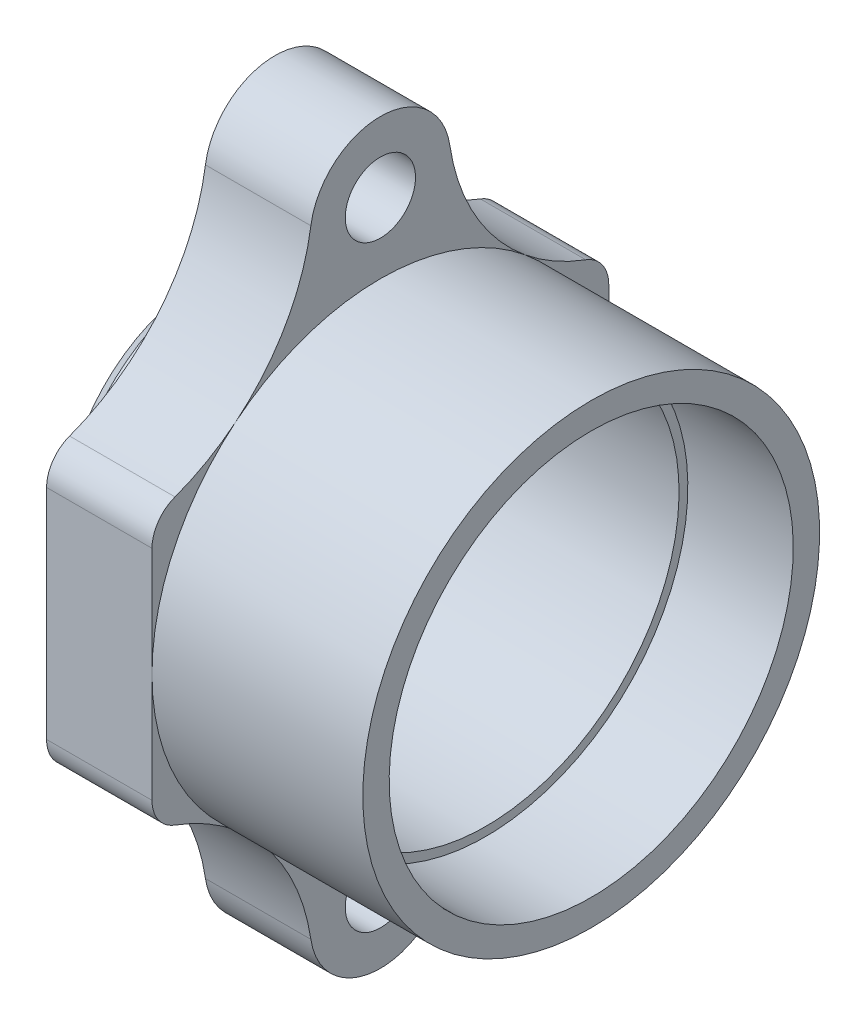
from build123d import *

# Parameters (mm, degrees)
CHANFREIN1_SIZE    = 0.5
ESQUISSE2_R        = 1
ESQUISSE2_R_2      = 5.5
BOSS_EXTRU_1_DEPTH = 3


with BuildPart() as part:
    # Esquisse1 → Base-R_volution (revolve)
    with BuildSketch(Plane.XY):
        Polygon((5.7, 3.5), (2.7, 3.5), (2.7, 3.25), (-2.3, 3.25), (-2.3, 0.75), (-5.3, 0.75), (-5.3, 2.25), (-3.3, 2.25), (-3.3, 4.25), (5.7, 4.25), align=None)
    revolve(axis=Axis((8.313555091, -2.25, 0), (-1, 0, 0)))

    # Chanfrein1
    chanfrein1_edges = [part.edges().sort_by_distance(p)[0] for p in [
        (-5.3, -6.75, 0),
    ]]
    chamfer(chanfrein1_edges, length=CHANFREIN1_SIZE)

    # Esquisse2 → Boss.-Extru.1 (add)
    with BuildSketch(Plane.ZY.offset(3.3)):
        with BuildLine():
            Line((-6.5, 0.855525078), (-6.5, -5.355525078))
            ThreePointArc((-6.5, -5.355525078), (-6.319974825, -5.927924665), (-5.844717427, -6.29423158))
            ThreePointArc((-5.844717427, -6.29423158), (-3.259782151, -8.138679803), (-1.978255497, -11.044117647))
            ThreePointArc((-1.978255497, -11.044117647), (0, -12.75), (1.978255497, -11.044117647))
            ThreePointArc((1.978255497, -11.044117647), (3.259782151, -8.138679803), (5.844717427, -6.29423158))
            ThreePointArc((5.844717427, -6.29423158), (6.319974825, -5.927924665), (6.5, -5.355525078))
            Line((6.5, -5.355525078), (6.5, 0.855525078))
            ThreePointArc((6.5, 0.855525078), (6.319974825, 1.427924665), (5.844717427, 1.79423158))
            ThreePointArc((5.844717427, 1.79423158), (3.259782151, 3.638679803), (1.978255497, 6.544117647))
            ThreePointArc((1.978255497, 6.544117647), (0, 8.25), (-1.978255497, 6.544117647))
            ThreePointArc((-1.978255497, 6.544117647), (-3.259782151, 3.638679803), (-5.844717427, 1.79423158))
            ThreePointArc((-5.844717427, 1.79423158), (-6.319974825, 1.427924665), (-6.5, 0.855525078))
        make_face()
        with Locations(Location((0, -10.75, 0), (0, 0, 270))):
            Circle(ESQUISSE2_R, mode=Mode.SUBTRACT)
        with Locations(Location((0, 6.25, 0), (0, 0, 90))):
            Circle(ESQUISSE2_R, mode=Mode.SUBTRACT)
        with Locations(Location((0, -2.25, 0), (0, 0, 90))):
            Circle(ESQUISSE2_R_2, mode=Mode.SUBTRACT)
    extrude(amount=-BOSS_EXTRU_1_DEPTH)


solid = part.part
